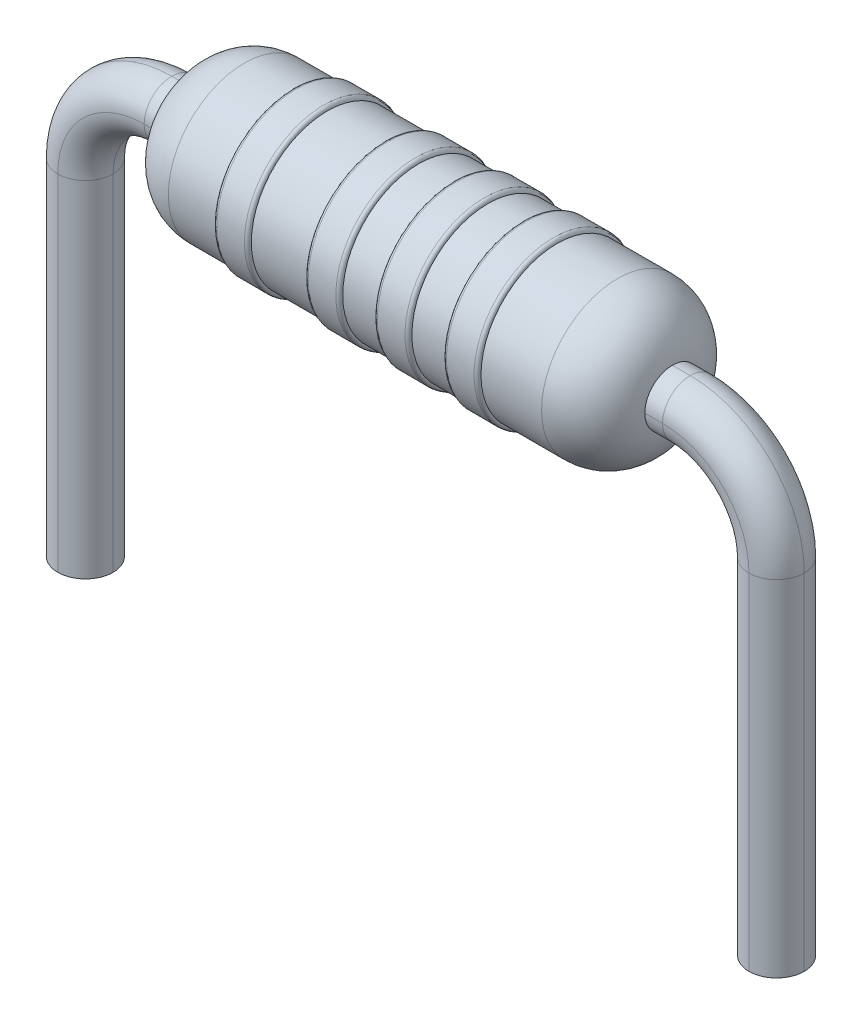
ISO-10303-21;
HEADER;
FILE_DESCRIPTION(('STEP AP214'),'2;1');
FILE_NAME('part.step','',(''),(''),'','','');
FILE_SCHEMA(('AUTOMOTIVE_DESIGN { 1 0 10303 214 1 1 1 1 }'));
ENDSEC;
DATA;
#1=APPLICATION_CONTEXT('core data for automotive mechanical design processes');
#2=APPLICATION_PROTOCOL_DEFINITION('international standard','automotive_design',2000,#1);
#3=PRODUCT_CONTEXT('',#1,'mechanical');
#4=PRODUCT('Part','Part','',(#3));
#5=PRODUCT_RELATED_PRODUCT_CATEGORY('part','',(#4));
#6=PRODUCT_DEFINITION_FORMATION('','',#4);
#7=PRODUCT_DEFINITION_CONTEXT('part definition',#1,'design');
#8=PRODUCT_DEFINITION('design','',#6,#7);
#9=PRODUCT_DEFINITION_SHAPE('','',#8);
#10=(LENGTH_UNIT() NAMED_UNIT(*) SI_UNIT(.MILLI.,.METRE.));
#11=(NAMED_UNIT(*) PLANE_ANGLE_UNIT() SI_UNIT($,.RADIAN.));
#12=(NAMED_UNIT(*) SI_UNIT($,.STERADIAN.) SOLID_ANGLE_UNIT());
#13=UNCERTAINTY_MEASURE_WITH_UNIT(LENGTH_MEASURE(1.E-05),#10,'distance_accuracy_value','');
#14=(GEOMETRIC_REPRESENTATION_CONTEXT(3) GLOBAL_UNCERTAINTY_ASSIGNED_CONTEXT((#13)) GLOBAL_UNIT_ASSIGNED_CONTEXT((#10,
#11,#12)) REPRESENTATION_CONTEXT('',''));
#15=CARTESIAN_POINT('',(0.,0.,0.));
#16=DIRECTION('',(0.,0.,1.));
#17=DIRECTION('',(1.,0.,0.));
#18=AXIS2_PLACEMENT_3D('',#15,#16,#17);
#19=CARTESIAN_POINT('',(2.7,0.,0.));
#20=DIRECTION('',(-1.,0.,0.));
#21=DIRECTION('',(0.,0.,1.));
#22=AXIS2_PLACEMENT_3D('',#19,#20,#21);
#23=DEGENERATE_TOROIDAL_SURFACE('',#22,0.3,0.8,.T.);
#24=CARTESIAN_POINT('',(3.49371157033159,0.00936677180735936,-0.4));
#25=CARTESIAN_POINT('',(3.49377803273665,-0.0131366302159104,-0.400019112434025));
#26=CARTESIAN_POINT('',(3.49384404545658,-0.0356343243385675,-0.398102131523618));
#27=CARTESIAN_POINT('',(3.49397338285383,-0.0799761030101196,-0.390537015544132));
#28=CARTESIAN_POINT('',(3.49403670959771,-0.101820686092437,-0.384891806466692));
#29=CARTESIAN_POINT('',(3.49415902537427,-0.144261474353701,-0.370007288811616));
#30=CARTESIAN_POINT('',(3.4942180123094,-0.164857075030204,-0.360766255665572));
#31=CARTESIAN_POINT('',(3.4943300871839,-0.204201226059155,-0.338960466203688));
#32=CARTESIAN_POINT('',(3.49438317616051,-0.222950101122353,-0.326396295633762));
#33=CARTESIAN_POINT('',(3.49448214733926,-0.258072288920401,-0.298298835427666));
#34=CARTESIAN_POINT('',(3.49452802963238,-0.274445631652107,-0.282765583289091));
#35=CARTESIAN_POINT('',(3.49461150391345,-0.304355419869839,-0.249167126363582));
#36=CARTESIAN_POINT('',(3.49464909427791,-0.317891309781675,-0.231101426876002));
#37=CARTESIAN_POINT('',(3.49471511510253,-0.341739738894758,-0.192952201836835));
#38=CARTESIAN_POINT('',(3.49474354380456,-0.352051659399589,-0.172868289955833));
#39=CARTESIAN_POINT('',(3.49479058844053,-0.369151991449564,-0.131258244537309));
#40=CARTESIAN_POINT('',(3.49480921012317,-0.375942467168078,-0.109732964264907));
#41=CARTESIAN_POINT('',(3.49483161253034,-0.38411954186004,-0.0733966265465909));
#42=CARTESIAN_POINT('',(3.4948382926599,-0.386560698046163,-0.0588141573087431));
#43=CARTESIAN_POINT('',(3.49484720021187,-0.389817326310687,-0.0294898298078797));
#44=CARTESIAN_POINT('',(3.494849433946,-0.39063510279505,-0.014748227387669));
#45=CARTESIAN_POINT('',(3.49484943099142,-0.390633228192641,0.));
#46=B_SPLINE_CURVE_WITH_KNOTS('',3,(#24,#25,#26,#27,#28,#29,#30,#31,#32,#33,#34,#35,#36,#37,#38,
#39,#40,#41,#42,#43,#44,#45),.UNSPECIFIED.,.F.,.F.,(4,2,2,2,2,2,2,2,2,2,4),(0.,
0.0674208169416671,0.134788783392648,0.202189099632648,0.269577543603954,0.336965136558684,
0.404365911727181,0.47177961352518,0.539153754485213,0.583425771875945,0.627634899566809),.UNSPECIFIED.);
#47=CARTESIAN_POINT('',(3.49371157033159,0.00936677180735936,-0.4));
#48=VERTEX_POINT('',#47);
#49=CARTESIAN_POINT('',(3.49484943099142,-0.390633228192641,0.));
#50=VERTEX_POINT('',#49);
#51=EDGE_CURVE('E47',#48,#50,#46,.T.);
#52=ORIENTED_EDGE('',*,*,#51,.T.);
#53=CARTESIAN_POINT('',(3.49484943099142,-0.390633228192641,0.));
#54=CARTESIAN_POINT('',(3.49484947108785,-0.390652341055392,0.0225032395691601));
#55=CARTESIAN_POINT('',(3.49484424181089,-0.38873538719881,0.0450007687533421));
#56=CARTESIAN_POINT('',(3.49482354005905,-0.381170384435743,0.0893422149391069));
#57=CARTESIAN_POINT('',(3.4948080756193,-0.375525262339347,0.111186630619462));
#58=CARTESIAN_POINT('',(3.49476718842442,-0.360640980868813,0.153627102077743));
#59=CARTESIAN_POINT('',(3.49474176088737,-0.351400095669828,0.174222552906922));
#60=CARTESIAN_POINT('',(3.49468152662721,-0.32959466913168,0.213566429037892));
#61=CARTESIAN_POINT('',(3.4946467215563,-0.317030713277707,0.232315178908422));
#62=CARTESIAN_POINT('',(3.49456851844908,-0.288933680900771,0.267437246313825));
#63=CARTESIAN_POINT('',(3.4945251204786,-0.273400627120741,0.283810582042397));
#64=CARTESIAN_POINT('',(3.49443074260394,-0.239802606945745,0.313720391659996));
#65=CARTESIAN_POINT('',(3.49437976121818,-0.221737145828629,0.327256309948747));
#66=CARTESIAN_POINT('',(3.49427146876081,-0.183588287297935,0.351104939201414));
#67=CARTESIAN_POINT('',(3.4942141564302,-0.163504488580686,0.361417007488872));
#68=CARTESIAN_POINT('',(3.49409468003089,-0.121894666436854,0.378517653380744));
#69=CARTESIAN_POINT('',(3.49403251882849,-0.100369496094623,0.385308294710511));
#70=CARTESIAN_POINT('',(3.49392692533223,-0.0640327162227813,0.393485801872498));
#71=CARTESIAN_POINT('',(3.4938843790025,-0.0494496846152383,0.395927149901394));
#72=CARTESIAN_POINT('',(3.49379847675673,-0.0201242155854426,0.399184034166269));
#73=CARTESIAN_POINT('',(3.49375512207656,-0.00538203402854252,0.400001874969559));
#74=CARTESIAN_POINT('',(3.49371157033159,0.00936677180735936,0.4));
#75=B_SPLINE_CURVE_WITH_KNOTS('',3,(#53,#54,#55,#56,#57,#58,#59,#60,#61,#62,#63,#64,#65,#66,#67,
#68,#69,#70,#71,#72,#73,#74),.UNSPECIFIED.,.F.,.F.,(4,2,2,2,2,2,2,2,2,2,4),(0.,
0.0674200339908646,0.134787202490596,0.202186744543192,0.269574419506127,0.33696157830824,
0.404361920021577,0.471775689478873,0.539149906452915,0.583423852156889,0.627634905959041),.UNSPECIFIED.);
#76=CARTESIAN_POINT('',(3.49371157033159,0.00936677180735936,0.4));
#77=VERTEX_POINT('',#76);
#78=EDGE_CURVE('E386',#50,#77,#75,.T.);
#79=ORIENTED_EDGE('',*,*,#78,.T.);
#80=CARTESIAN_POINT('',(3.49371157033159,0.00936677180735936,0.4));
#81=CARTESIAN_POINT('',(3.49364513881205,0.0318701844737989,0.400019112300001));
#82=CARTESIAN_POINT('',(3.49357829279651,0.0543678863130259,0.398102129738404));
#83=CARTESIAN_POINT('',(3.49344578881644,0.0987096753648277,0.390537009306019));
#84=CARTESIAN_POINT('',(3.49338012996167,0.120554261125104,0.384891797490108));
#85=CARTESIAN_POINT('',(3.49325187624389,0.162995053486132,0.370007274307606));
#86=CARTESIAN_POINT('',(3.49318928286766,0.183590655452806,0.360766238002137));
#87=CARTESIAN_POINT('',(3.49306913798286,0.22293480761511,0.338960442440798));
#88=CARTESIAN_POINT('',(3.4930115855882,0.241683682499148,0.326396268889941));
#89=CARTESIAN_POINT('',(3.49290333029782,0.276805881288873,0.298298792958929));
#90=CARTESIAN_POINT('',(3.49285262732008,0.293179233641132,0.282765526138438));
#91=CARTESIAN_POINT('',(3.49275969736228,0.3230890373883,0.249167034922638));
#92=CARTESIAN_POINT('',(3.49271747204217,0.336624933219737,0.231101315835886));
#93=CARTESIAN_POINT('',(3.4926428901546,0.36047336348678,0.192952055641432));
#94=CARTESIAN_POINT('',(3.49261053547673,0.370785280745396,0.172868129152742));
#95=CARTESIAN_POINT('',(3.49255679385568,0.387885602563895,0.131258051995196));
#96=CARTESIAN_POINT('',(3.49253540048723,0.3946760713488,0.109732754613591));
#97=CARTESIAN_POINT('',(3.49250961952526,0.402853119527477,0.0733964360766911));
#98=CARTESIAN_POINT('',(3.4925019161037,0.40529426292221,0.0588140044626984));
#99=CARTESIAN_POINT('',(3.4924916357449,0.408550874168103,0.0294897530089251));
#100=CARTESIAN_POINT('',(3.49248905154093,0.409368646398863,0.0147481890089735));
#101=CARTESIAN_POINT('',(3.49248905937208,0.409366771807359,0.));
#102=B_SPLINE_CURVE_WITH_KNOTS('',3,(#80,#81,#82,#83,#84,#85,#86,#87,#88,#89,#90,#91,#92,#93,
#94,#95,#96,#97,#98,#99,#100,#101),.UNSPECIFIED.,.F.,.F.,(4,2,2,2,2,2,2,2,2,2,4),(0.,
0.0674208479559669,0.13478884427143,0.202189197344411,0.269577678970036,0.336965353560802,
0.404366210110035,0.47177996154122,0.539154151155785,0.583426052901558,0.627635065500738),.UNSPECIFIED.);
#103=CARTESIAN_POINT('',(3.49248905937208,0.409366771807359,0.));
#104=VERTEX_POINT('',#103);
#105=EDGE_CURVE('E180',#77,#104,#102,.T.);
#106=ORIENTED_EDGE('',*,*,#105,.T.);
#107=CARTESIAN_POINT('',(3.49248905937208,0.409366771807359,0.));
#108=CARTESIAN_POINT('',(3.49248898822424,0.409385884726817,-0.0225032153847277));
#109=CARTESIAN_POINT('',(3.49249505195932,0.407468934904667,-0.0450007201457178));
#110=CARTESIAN_POINT('',(3.49251892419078,0.399903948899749,-0.0893421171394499));
#111=CARTESIAN_POINT('',(3.49253672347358,0.394258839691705,-0.111186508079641));
#112=CARTESIAN_POINT('',(3.49258355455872,0.3793745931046,-0.153626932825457));
#113=CARTESIAN_POINT('',(3.49261259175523,0.370133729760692,-0.174222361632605));
#114=CARTESIAN_POINT('',(3.49268090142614,0.348328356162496,-0.213566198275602));
#115=CARTESIAN_POINT('',(3.49272017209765,0.335764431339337,-0.232314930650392));
#116=CARTESIAN_POINT('',(3.49280766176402,0.307667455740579,-0.267436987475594));
#117=CARTESIAN_POINT('',(3.49285588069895,0.292134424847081,-0.283810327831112));
#118=CARTESIAN_POINT('',(3.4929597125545,0.258536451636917,-0.313720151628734));
#119=CARTESIAN_POINT('',(3.4930153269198,0.240471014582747,-0.327256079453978));
#120=CARTESIAN_POINT('',(3.49313217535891,0.202322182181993,-0.351104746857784));
#121=CARTESIAN_POINT('',(3.4931934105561,0.182238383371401,-0.361416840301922));
#122=CARTESIAN_POINT('',(3.49331957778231,0.14062855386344,-0.378517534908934));
#123=CARTESIAN_POINT('',(3.49338450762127,0.119103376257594,-0.385308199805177));
#124=CARTESIAN_POINT('',(3.4934934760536,0.0827665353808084,-0.393485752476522));
#125=CARTESIAN_POINT('',(3.49353704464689,0.0681834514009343,-0.395927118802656));
#126=CARTESIAN_POINT('',(3.49362431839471,0.0388578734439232,-0.399184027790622));
#127=CARTESIAN_POINT('',(3.49366802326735,0.0241156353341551,-0.400001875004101));
#128=CARTESIAN_POINT('',(3.49371157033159,0.00936677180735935,-0.4));
#129=B_SPLINE_CURVE_WITH_KNOTS('',3,(#107,#108,#109,#110,#111,#112,#113,#114,#115,#116,#117,
#118,#119,#120,#121,#122,#123,#124,#125,#126,#127,#128),.UNSPECIFIED.,.F.,.F.,(4,2,2,2,2,2,2,2,
2,2,4),(0.,0.0674199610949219,0.134787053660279,0.202186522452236,0.26957412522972,
0.336961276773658,0.404361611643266,0.471775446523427,0.539149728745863,0.58342384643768,
0.627635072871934),.UNSPECIFIED.);
#130=EDGE_CURVE('E410',#104,#48,#129,.T.);
#131=ORIENTED_EDGE('',*,*,#130,.T.);
#132=EDGE_LOOP('',(#52,#79,#106,#131));
#133=FACE_BOUND('',#132,.T.);
#134=CARTESIAN_POINT('',(2.69999999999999,0.,0.));
#135=DIRECTION('',(-1.,0.,0.));
#136=DIRECTION('',(0.,0.,1.));
#137=AXIS2_PLACEMENT_3D('',#134,#135,#136);
#138=CIRCLE('',#137,1.1);
#139=CARTESIAN_POINT('',(2.69999999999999,0.,1.1));
#140=VERTEX_POINT('',#139);
#141=EDGE_CURVE('E276',#140,#140,#138,.T.);
#142=ORIENTED_EDGE('',*,*,#141,.F.);
#143=EDGE_LOOP('',(#142));
#144=FACE_BOUND('',#143,.T.);
#145=ADVANCED_FACE('F27',(#133,#144),#23,.T.);
#146=CARTESIAN_POINT('',(-2.7,0.,0.));
#147=DIRECTION('',(-1.,0.,0.));
#148=DIRECTION('',(0.,0.,1.));
#149=AXIS2_PLACEMENT_3D('',#146,#147,#148);
#150=DEGENERATE_TOROIDAL_SURFACE('',#149,0.3,0.8,.T.);
#151=CARTESIAN_POINT('',(-3.49371157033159,0.00936677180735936,-0.4));
#152=CARTESIAN_POINT('',(-3.49364513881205,0.0318701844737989,-0.400019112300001));
#153=CARTESIAN_POINT('',(-3.49357829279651,0.0543678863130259,-0.398102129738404));
#154=CARTESIAN_POINT('',(-3.49344578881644,0.0987096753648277,-0.390537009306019));
#155=CARTESIAN_POINT('',(-3.49338012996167,0.120554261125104,-0.384891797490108));
#156=CARTESIAN_POINT('',(-3.49325187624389,0.162995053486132,-0.370007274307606));
#157=CARTESIAN_POINT('',(-3.49318928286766,0.183590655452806,-0.360766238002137));
#158=CARTESIAN_POINT('',(-3.49306913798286,0.22293480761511,-0.338960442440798));
#159=CARTESIAN_POINT('',(-3.4930115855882,0.241683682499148,-0.326396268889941));
#160=CARTESIAN_POINT('',(-3.49290333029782,0.276805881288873,-0.298298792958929));
#161=CARTESIAN_POINT('',(-3.49285262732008,0.293179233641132,-0.282765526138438));
#162=CARTESIAN_POINT('',(-3.49275969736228,0.3230890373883,-0.249167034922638));
#163=CARTESIAN_POINT('',(-3.49271747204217,0.336624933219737,-0.231101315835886));
#164=CARTESIAN_POINT('',(-3.4926428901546,0.36047336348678,-0.192952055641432));
#165=CARTESIAN_POINT('',(-3.49261053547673,0.370785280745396,-0.172868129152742));
#166=CARTESIAN_POINT('',(-3.49255679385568,0.387885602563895,-0.131258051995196));
#167=CARTESIAN_POINT('',(-3.49253540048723,0.3946760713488,-0.109732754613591));
#168=CARTESIAN_POINT('',(-3.49250961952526,0.402853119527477,-0.0733964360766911));
#169=CARTESIAN_POINT('',(-3.4925019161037,0.40529426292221,-0.0588140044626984));
#170=CARTESIAN_POINT('',(-3.4924916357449,0.408550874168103,-0.0294897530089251));
#171=CARTESIAN_POINT('',(-3.49248905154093,0.409368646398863,-0.0147481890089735));
#172=CARTESIAN_POINT('',(-3.49248905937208,0.409366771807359,0.));
#173=B_SPLINE_CURVE_WITH_KNOTS('',3,(#151,#152,#153,#154,#155,#156,#157,#158,#159,#160,#161,
#162,#163,#164,#165,#166,#167,#168,#169,#170,#171,#172),.UNSPECIFIED.,.F.,.F.,(4,2,2,2,2,2,2,2,
2,2,4),(0.,0.0674208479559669,0.13478884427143,0.202189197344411,0.269577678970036,
0.336965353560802,0.404366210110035,0.47177996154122,0.539154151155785,0.583426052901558,
0.627635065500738),.UNSPECIFIED.);
#174=CARTESIAN_POINT('',(-3.49371157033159,0.00936677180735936,-0.4));
#175=VERTEX_POINT('',#174);
#176=CARTESIAN_POINT('',(-3.49248905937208,0.409366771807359,0.));
#177=VERTEX_POINT('',#176);
#178=EDGE_CURVE('E344',#175,#177,#173,.T.);
#179=ORIENTED_EDGE('',*,*,#178,.T.);
#180=CARTESIAN_POINT('',(-3.49248905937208,0.409366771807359,0.));
#181=CARTESIAN_POINT('',(-3.49248898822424,0.409385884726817,0.0225032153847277));
#182=CARTESIAN_POINT('',(-3.49249505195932,0.407468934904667,0.0450007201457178));
#183=CARTESIAN_POINT('',(-3.49251892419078,0.399903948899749,0.0893421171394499));
#184=CARTESIAN_POINT('',(-3.49253672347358,0.394258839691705,0.111186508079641));
#185=CARTESIAN_POINT('',(-3.49258355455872,0.3793745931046,0.153626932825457));
#186=CARTESIAN_POINT('',(-3.49261259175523,0.370133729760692,0.174222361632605));
#187=CARTESIAN_POINT('',(-3.49268090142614,0.348328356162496,0.213566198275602));
#188=CARTESIAN_POINT('',(-3.49272017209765,0.335764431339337,0.232314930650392));
#189=CARTESIAN_POINT('',(-3.49280766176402,0.307667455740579,0.267436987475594));
#190=CARTESIAN_POINT('',(-3.49285588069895,0.292134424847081,0.283810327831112));
#191=CARTESIAN_POINT('',(-3.4929597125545,0.258536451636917,0.313720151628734));
#192=CARTESIAN_POINT('',(-3.4930153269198,0.240471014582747,0.327256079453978));
#193=CARTESIAN_POINT('',(-3.49313217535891,0.202322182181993,0.351104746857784));
#194=CARTESIAN_POINT('',(-3.4931934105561,0.182238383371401,0.361416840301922));
#195=CARTESIAN_POINT('',(-3.49331957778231,0.14062855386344,0.378517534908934));
#196=CARTESIAN_POINT('',(-3.49338450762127,0.119103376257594,0.385308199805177));
#197=CARTESIAN_POINT('',(-3.4934934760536,0.0827665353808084,0.393485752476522));
#198=CARTESIAN_POINT('',(-3.49353704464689,0.0681834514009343,0.395927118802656));
#199=CARTESIAN_POINT('',(-3.49362431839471,0.0388578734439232,0.399184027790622));
#200=CARTESIAN_POINT('',(-3.49366802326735,0.0241156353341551,0.400001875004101));
#201=CARTESIAN_POINT('',(-3.49371157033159,0.00936677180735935,0.4));
#202=B_SPLINE_CURVE_WITH_KNOTS('',3,(#180,#181,#182,#183,#184,#185,#186,#187,#188,#189,#190,
#191,#192,#193,#194,#195,#196,#197,#198,#199,#200,#201),.UNSPECIFIED.,.F.,.F.,(4,2,2,2,2,2,2,2,
2,2,4),(0.,0.0674199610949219,0.134787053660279,0.202186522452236,0.26957412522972,
0.336961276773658,0.404361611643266,0.471775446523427,0.539149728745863,0.58342384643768,
0.627635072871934),.UNSPECIFIED.);
#203=CARTESIAN_POINT('',(-3.49371157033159,0.00936677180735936,0.4));
#204=VERTEX_POINT('',#203);
#205=EDGE_CURVE('E11',#177,#204,#202,.T.);
#206=ORIENTED_EDGE('',*,*,#205,.T.);
#207=CARTESIAN_POINT('',(-3.49371157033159,0.00936677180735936,0.4));
#208=CARTESIAN_POINT('',(-3.49377803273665,-0.0131366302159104,0.400019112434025));
#209=CARTESIAN_POINT('',(-3.49384404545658,-0.0356343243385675,0.398102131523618));
#210=CARTESIAN_POINT('',(-3.49397338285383,-0.0799761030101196,0.390537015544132));
#211=CARTESIAN_POINT('',(-3.49403670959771,-0.101820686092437,0.384891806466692));
#212=CARTESIAN_POINT('',(-3.49415902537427,-0.144261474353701,0.370007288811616));
#213=CARTESIAN_POINT('',(-3.4942180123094,-0.164857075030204,0.360766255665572));
#214=CARTESIAN_POINT('',(-3.4943300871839,-0.204201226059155,0.338960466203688));
#215=CARTESIAN_POINT('',(-3.49438317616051,-0.222950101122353,0.326396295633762));
#216=CARTESIAN_POINT('',(-3.49448214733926,-0.258072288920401,0.298298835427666));
#217=CARTESIAN_POINT('',(-3.49452802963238,-0.274445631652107,0.282765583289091));
#218=CARTESIAN_POINT('',(-3.49461150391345,-0.304355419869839,0.249167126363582));
#219=CARTESIAN_POINT('',(-3.49464909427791,-0.317891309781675,0.231101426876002));
#220=CARTESIAN_POINT('',(-3.49471511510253,-0.341739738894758,0.192952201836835));
#221=CARTESIAN_POINT('',(-3.49474354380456,-0.352051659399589,0.172868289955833));
#222=CARTESIAN_POINT('',(-3.49479058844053,-0.369151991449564,0.131258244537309));
#223=CARTESIAN_POINT('',(-3.49480921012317,-0.375942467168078,0.109732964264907));
#224=CARTESIAN_POINT('',(-3.49483161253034,-0.38411954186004,0.0733966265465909));
#225=CARTESIAN_POINT('',(-3.4948382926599,-0.386560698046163,0.0588141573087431));
#226=CARTESIAN_POINT('',(-3.49484720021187,-0.389817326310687,0.0294898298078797));
#227=CARTESIAN_POINT('',(-3.494849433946,-0.39063510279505,0.014748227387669));
#228=CARTESIAN_POINT('',(-3.49484943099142,-0.390633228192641,0.));
#229=B_SPLINE_CURVE_WITH_KNOTS('',3,(#207,#208,#209,#210,#211,#212,#213,#214,#215,#216,#217,
#218,#219,#220,#221,#222,#223,#224,#225,#226,#227,#228),.UNSPECIFIED.,.F.,.F.,(4,2,2,2,2,2,2,2,
2,2,4),(0.,0.0674208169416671,0.134788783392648,0.202189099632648,0.269577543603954,
0.336965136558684,0.404365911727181,0.47177961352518,0.539153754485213,0.583425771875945,
0.627634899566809),.UNSPECIFIED.);
#230=CARTESIAN_POINT('',(-3.49484943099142,-0.390633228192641,0.));
#231=VERTEX_POINT('',#230);
#232=EDGE_CURVE('E55',#204,#231,#229,.T.);
#233=ORIENTED_EDGE('',*,*,#232,.T.);
#234=CARTESIAN_POINT('',(-3.49484943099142,-0.390633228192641,0.));
#235=CARTESIAN_POINT('',(-3.49484947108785,-0.390652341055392,-0.0225032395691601));
#236=CARTESIAN_POINT('',(-3.49484424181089,-0.38873538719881,-0.0450007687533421));
#237=CARTESIAN_POINT('',(-3.49482354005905,-0.381170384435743,-0.0893422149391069));
#238=CARTESIAN_POINT('',(-3.4948080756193,-0.375525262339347,-0.111186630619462));
#239=CARTESIAN_POINT('',(-3.49476718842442,-0.360640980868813,-0.153627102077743));
#240=CARTESIAN_POINT('',(-3.49474176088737,-0.351400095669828,-0.174222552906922));
#241=CARTESIAN_POINT('',(-3.49468152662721,-0.32959466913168,-0.213566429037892));
#242=CARTESIAN_POINT('',(-3.4946467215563,-0.317030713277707,-0.232315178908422));
#243=CARTESIAN_POINT('',(-3.49456851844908,-0.288933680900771,-0.267437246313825));
#244=CARTESIAN_POINT('',(-3.4945251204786,-0.273400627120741,-0.283810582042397));
#245=CARTESIAN_POINT('',(-3.49443074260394,-0.239802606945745,-0.313720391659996));
#246=CARTESIAN_POINT('',(-3.49437976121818,-0.221737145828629,-0.327256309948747));
#247=CARTESIAN_POINT('',(-3.49427146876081,-0.183588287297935,-0.351104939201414));
#248=CARTESIAN_POINT('',(-3.4942141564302,-0.163504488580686,-0.361417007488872));
#249=CARTESIAN_POINT('',(-3.49409468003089,-0.121894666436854,-0.378517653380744));
#250=CARTESIAN_POINT('',(-3.49403251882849,-0.100369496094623,-0.385308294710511));
#251=CARTESIAN_POINT('',(-3.49392692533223,-0.0640327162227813,-0.393485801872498));
#252=CARTESIAN_POINT('',(-3.4938843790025,-0.0494496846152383,-0.395927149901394));
#253=CARTESIAN_POINT('',(-3.49379847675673,-0.0201242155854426,-0.399184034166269));
#254=CARTESIAN_POINT('',(-3.49375512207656,-0.00538203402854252,-0.400001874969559));
#255=CARTESIAN_POINT('',(-3.49371157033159,0.00936677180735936,-0.4));
#256=B_SPLINE_CURVE_WITH_KNOTS('',3,(#234,#235,#236,#237,#238,#239,#240,#241,#242,#243,#244,
#245,#246,#247,#248,#249,#250,#251,#252,#253,#254,#255),.UNSPECIFIED.,.F.,.F.,(4,2,2,2,2,2,2,2,
2,2,4),(0.,0.0674200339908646,0.134787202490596,0.202186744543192,0.269574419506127,
0.33696157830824,0.404361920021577,0.471775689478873,0.539149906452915,0.583423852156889,
0.627634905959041),.UNSPECIFIED.);
#257=EDGE_CURVE('E40',#231,#175,#256,.T.);
#258=ORIENTED_EDGE('',*,*,#257,.T.);
#259=EDGE_LOOP('',(#179,#206,#233,#258));
#260=FACE_BOUND('',#259,.T.);
#261=CARTESIAN_POINT('',(-2.69999999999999,0.,0.));
#262=DIRECTION('',(-1.,0.,0.));
#263=DIRECTION('',(0.,0.,1.));
#264=AXIS2_PLACEMENT_3D('',#261,#262,#263);
#265=CIRCLE('',#264,1.1);
#266=CARTESIAN_POINT('',(-2.69999999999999,0.,1.1));
#267=VERTEX_POINT('',#266);
#268=EDGE_CURVE('E273',#267,#267,#265,.T.);
#269=ORIENTED_EDGE('',*,*,#268,.T.);
#270=EDGE_LOOP('',(#269));
#271=FACE_BOUND('',#270,.T.);
#272=ADVANCED_FACE('F356',(#260,#271),#150,.T.);
#273=CARTESIAN_POINT('',(-54.2686615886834,0.,0.));
#274=DIRECTION('',(-1.,0.,0.));
#275=DIRECTION('',(0.,0.,1.));
#276=AXIS2_PLACEMENT_3D('',#273,#274,#275);
#277=CYLINDRICAL_SURFACE('',#276,1.1);
#278=CARTESIAN_POINT('',(0.322975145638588,0.,0.));
#279=DIRECTION('',(-1.,0.,0.));
#280=DIRECTION('',(0.,0.,1.));
#281=AXIS2_PLACEMENT_3D('',#278,#279,#280);
#282=CIRCLE('',#281,1.1);
#283=CARTESIAN_POINT('',(0.322975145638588,0.,1.1));
#284=VERTEX_POINT('',#283);
#285=EDGE_CURVE('E287',#284,#284,#282,.T.);
#286=ORIENTED_EDGE('',*,*,#285,.T.);
#287=EDGE_LOOP('',(#286));
#288=FACE_BOUND('',#287,.T.);
#289=CARTESIAN_POINT('',(-0.177024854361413,0.,0.));
#290=DIRECTION('',(1.,0.,0.));
#291=DIRECTION('',(0.,0.,-1.));
#292=AXIS2_PLACEMENT_3D('',#289,#290,#291);
#293=CIRCLE('',#292,1.1);
#294=CARTESIAN_POINT('',(-0.177024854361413,0.,-1.1));
#295=VERTEX_POINT('',#294);
#296=EDGE_CURVE('E277',#295,#295,#293,.T.);
#297=ORIENTED_EDGE('',*,*,#296,.T.);
#298=EDGE_LOOP('',(#297));
#299=FACE_BOUND('',#298,.T.);
#300=ADVANCED_FACE('F498',(#288,#299),#277,.T.);
#301=CARTESIAN_POINT('',(4.3261723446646,0.,0.));
#302=DIRECTION('',(1.,0.,0.));
#303=DIRECTION('',(0.,0.,-1.));
#304=AXIS2_PLACEMENT_3D('',#301,#302,#303);
#305=CYLINDRICAL_SURFACE('',#304,1.15);
#306=CARTESIAN_POINT('',(-0.627024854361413,0.,0.));
#307=DIRECTION('',(-1.,0.,0.));
#308=DIRECTION('',(0.,0.,1.));
#309=AXIS2_PLACEMENT_3D('',#306,#307,#308);
#310=CIRCLE('',#309,1.15);
#311=CARTESIAN_POINT('',(-0.627024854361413,0.,1.15));
#312=VERTEX_POINT('',#311);
#313=EDGE_CURVE('E311',#312,#312,#310,.F.);
#314=ORIENTED_EDGE('',*,*,#313,.T.);
#315=EDGE_LOOP('',(#314));
#316=FACE_BOUND('',#315,.T.);
#317=CARTESIAN_POINT('',(-0.227024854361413,0.,0.));
#318=DIRECTION('',(1.,0.,0.));
#319=DIRECTION('',(0.,0.,-1.));
#320=AXIS2_PLACEMENT_3D('',#317,#318,#319);
#321=CIRCLE('',#320,1.15);
#322=CARTESIAN_POINT('',(-0.227024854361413,0.,-1.15));
#323=VERTEX_POINT('',#322);
#324=EDGE_CURVE('E308',#323,#323,#321,.F.);
#325=ORIENTED_EDGE('',*,*,#324,.T.);
#326=EDGE_LOOP('',(#325));
#327=FACE_BOUND('',#326,.T.);
#328=ADVANCED_FACE('F496',(#316,#327),#305,.T.);
#329=CARTESIAN_POINT('',(-1.5,0.,0.));
#330=DIRECTION('',(1.,0.,0.));
#331=DIRECTION('',(0.,0.,-1.));
#332=AXIS2_PLACEMENT_3D('',#329,#330,#331);
#333=CIRCLE('',#332,1.1);
#334=CARTESIAN_POINT('',(-1.5,0.,-1.1));
#335=VERTEX_POINT('',#334);
#336=EDGE_CURVE('E272',#335,#335,#333,.T.);
#337=ORIENTED_EDGE('',*,*,#336,.T.);
#338=EDGE_LOOP('',(#337));
#339=FACE_BOUND('',#338,.T.);
#340=CARTESIAN_POINT('',(-0.677024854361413,0.,0.));
#341=DIRECTION('',(-1.,0.,0.));
#342=DIRECTION('',(0.,0.,1.));
#343=AXIS2_PLACEMENT_3D('',#340,#341,#342);
#344=CIRCLE('',#343,1.1);
#345=CARTESIAN_POINT('',(-0.677024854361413,0.,1.1));
#346=VERTEX_POINT('',#345);
#347=EDGE_CURVE('E281',#346,#346,#344,.T.);
#348=ORIENTED_EDGE('',*,*,#347,.T.);
#349=EDGE_LOOP('',(#348));
#350=FACE_BOUND('',#349,.T.);
#351=ADVANCED_FACE('F494',(#339,#350),#277,.T.);
#352=CARTESIAN_POINT('',(4.3261723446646,0.,0.));
#353=DIRECTION('',(1.,0.,0.));
#354=DIRECTION('',(0.,0.,-1.));
#355=AXIS2_PLACEMENT_3D('',#352,#353,#354);
#356=CYLINDRICAL_SURFACE('',#355,1.15);
#357=CARTESIAN_POINT('',(0.372975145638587,0.,0.));
#358=DIRECTION('',(-1.,0.,0.));
#359=DIRECTION('',(0.,0.,1.));
#360=AXIS2_PLACEMENT_3D('',#357,#358,#359);
#361=CIRCLE('',#360,1.15);
#362=CARTESIAN_POINT('',(0.372975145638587,0.,1.15));
#363=VERTEX_POINT('',#362);
#364=EDGE_CURVE('E317',#363,#363,#361,.F.);
#365=ORIENTED_EDGE('',*,*,#364,.T.);
#366=EDGE_LOOP('',(#365));
#367=FACE_BOUND('',#366,.T.);
#368=CARTESIAN_POINT('',(0.772975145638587,0.,0.));
#369=DIRECTION('',(1.,0.,0.));
#370=DIRECTION('',(0.,0.,-1.));
#371=AXIS2_PLACEMENT_3D('',#368,#369,#370);
#372=CIRCLE('',#371,1.15);
#373=CARTESIAN_POINT('',(0.772975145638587,0.,-1.15));
#374=VERTEX_POINT('',#373);
#375=EDGE_CURVE('E314',#374,#374,#372,.F.);
#376=ORIENTED_EDGE('',*,*,#375,.T.);
#377=EDGE_LOOP('',(#376));
#378=FACE_BOUND('',#377,.T.);
#379=ADVANCED_FACE('F492',(#367,#378),#356,.T.);
#380=CARTESIAN_POINT('',(1.32297514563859,0.,0.));
#381=DIRECTION('',(-1.,0.,0.));
#382=DIRECTION('',(0.,0.,1.));
#383=AXIS2_PLACEMENT_3D('',#380,#381,#382);
#384=CIRCLE('',#383,1.1);
#385=CARTESIAN_POINT('',(1.32297514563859,0.,1.1));
#386=VERTEX_POINT('',#385);
#387=EDGE_CURVE('E293',#386,#386,#384,.T.);
#388=ORIENTED_EDGE('',*,*,#387,.T.);
#389=EDGE_LOOP('',(#388));
#390=FACE_BOUND('',#389,.T.);
#391=CARTESIAN_POINT('',(0.822975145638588,0.,0.));
#392=DIRECTION('',(1.,0.,0.));
#393=DIRECTION('',(0.,0.,-1.));
#394=AXIS2_PLACEMENT_3D('',#391,#392,#393);
#395=CIRCLE('',#394,1.1);
#396=CARTESIAN_POINT('',(0.822975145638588,0.,-1.1));
#397=VERTEX_POINT('',#396);
#398=EDGE_CURVE('E284',#397,#397,#395,.T.);
#399=ORIENTED_EDGE('',*,*,#398,.T.);
#400=EDGE_LOOP('',(#399));
#401=FACE_BOUND('',#400,.T.);
#402=ADVANCED_FACE('F490',(#390,#401),#277,.T.);
#403=CARTESIAN_POINT('',(4.3261723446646,0.,0.));
#404=DIRECTION('',(1.,0.,0.));
#405=DIRECTION('',(0.,0.,-1.));
#406=AXIS2_PLACEMENT_3D('',#403,#404,#405);
#407=CYLINDRICAL_SURFACE('',#406,1.15);
#408=CARTESIAN_POINT('',(1.37297514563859,0.,0.));
#409=DIRECTION('',(-1.,0.,0.));
#410=DIRECTION('',(0.,0.,1.));
#411=AXIS2_PLACEMENT_3D('',#408,#409,#410);
#412=CIRCLE('',#411,1.15);
#413=CARTESIAN_POINT('',(1.37297514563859,0.,1.15));
#414=VERTEX_POINT('',#413);
#415=EDGE_CURVE('E323',#414,#414,#412,.F.);
#416=ORIENTED_EDGE('',*,*,#415,.T.);
#417=EDGE_LOOP('',(#416));
#418=FACE_BOUND('',#417,.T.);
#419=CARTESIAN_POINT('',(1.77297514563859,0.,0.));
#420=DIRECTION('',(1.,0.,0.));
#421=DIRECTION('',(0.,0.,-1.));
#422=AXIS2_PLACEMENT_3D('',#419,#420,#421);
#423=CIRCLE('',#422,1.15);
#424=CARTESIAN_POINT('',(1.77297514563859,0.,-1.15));
#425=VERTEX_POINT('',#424);
#426=EDGE_CURVE('E320',#425,#425,#423,.F.);
#427=ORIENTED_EDGE('',*,*,#426,.T.);
#428=EDGE_LOOP('',(#427));
#429=FACE_BOUND('',#428,.T.);
#430=ADVANCED_FACE('F487',(#418,#429),#407,.T.);
#431=CARTESIAN_POINT('',(1.82297514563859,0.,0.));
#432=DIRECTION('',(1.,0.,0.));
#433=DIRECTION('',(0.,0.,-1.));
#434=AXIS2_PLACEMENT_3D('',#431,#432,#433);
#435=CIRCLE('',#434,1.1);
#436=CARTESIAN_POINT('',(1.82297514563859,0.,-1.1));
#437=VERTEX_POINT('',#436);
#438=EDGE_CURVE('E290',#437,#437,#435,.T.);
#439=ORIENTED_EDGE('',*,*,#438,.T.);
#440=EDGE_LOOP('',(#439));
#441=FACE_BOUND('',#440,.T.);
#442=ORIENTED_EDGE('',*,*,#141,.T.);
#443=EDGE_LOOP('',(#442));
#444=FACE_BOUND('',#443,.T.);
#445=ADVANCED_FACE('F485',(#441,#444),#277,.T.);
#446=CARTESIAN_POINT('',(4.3261723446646,0.,0.));
#447=DIRECTION('',(1.,0.,0.));
#448=DIRECTION('',(0.,0.,-1.));
#449=AXIS2_PLACEMENT_3D('',#446,#447,#448);
#450=CYLINDRICAL_SURFACE('',#449,1.15);
#451=CARTESIAN_POINT('',(-1.95,0.,0.));
#452=DIRECTION('',(-1.,0.,0.));
#453=DIRECTION('',(0.,0.,1.));
#454=AXIS2_PLACEMENT_3D('',#451,#452,#453);
#455=CIRCLE('',#454,1.15);
#456=CARTESIAN_POINT('',(-1.95,0.,1.15));
#457=VERTEX_POINT('',#456);
#458=EDGE_CURVE('E305',#457,#457,#455,.F.);
#459=ORIENTED_EDGE('',*,*,#458,.T.);
#460=EDGE_LOOP('',(#459));
#461=FACE_BOUND('',#460,.T.);
#462=CARTESIAN_POINT('',(-1.55,0.,0.));
#463=DIRECTION('',(1.,0.,0.));
#464=DIRECTION('',(0.,0.,-1.));
#465=AXIS2_PLACEMENT_3D('',#462,#463,#464);
#466=CIRCLE('',#465,1.15);
#467=CARTESIAN_POINT('',(-1.55,0.,-1.15));
#468=VERTEX_POINT('',#467);
#469=EDGE_CURVE('E280',#468,#468,#466,.F.);
#470=ORIENTED_EDGE('',*,*,#469,.T.);
#471=EDGE_LOOP('',(#470));
#472=FACE_BOUND('',#471,.T.);
#473=ADVANCED_FACE('F482',(#461,#472),#450,.T.);
#474=CARTESIAN_POINT('',(-2.,0.,0.));
#475=DIRECTION('',(-1.,0.,0.));
#476=DIRECTION('',(0.,0.,1.));
#477=AXIS2_PLACEMENT_3D('',#474,#475,#476);
#478=CIRCLE('',#477,1.1);
#479=CARTESIAN_POINT('',(-2.,0.,1.1));
#480=VERTEX_POINT('',#479);
#481=EDGE_CURVE('E296',#480,#480,#478,.T.);
#482=ORIENTED_EDGE('',*,*,#481,.T.);
#483=EDGE_LOOP('',(#482));
#484=FACE_BOUND('',#483,.T.);
#485=ORIENTED_EDGE('',*,*,#268,.F.);
#486=EDGE_LOOP('',(#485));
#487=FACE_BOUND('',#486,.T.);
#488=ADVANCED_FACE('F480',(#484,#487),#277,.T.);
#489=CARTESIAN_POINT('',(-1.95,0.,0.));
#490=DIRECTION('',(-1.,0.,0.));
#491=DIRECTION('',(0.,0.,1.));
#492=AXIS2_PLACEMENT_3D('',#489,#490,#491);
#493=TOROIDAL_SURFACE('',#492,1.1,0.05);
#494=ORIENTED_EDGE('',*,*,#481,.F.);
#495=EDGE_LOOP('',(#494));
#496=FACE_BOUND('',#495,.T.);
#497=ORIENTED_EDGE('',*,*,#458,.F.);
#498=EDGE_LOOP('',(#497));
#499=FACE_BOUND('',#498,.T.);
#500=ADVANCED_FACE('F476',(#496,#499),#493,.T.);
#501=CARTESIAN_POINT('',(-1.55,0.,0.));
#502=DIRECTION('',(1.,0.,0.));
#503=DIRECTION('',(0.,0.,-1.));
#504=AXIS2_PLACEMENT_3D('',#501,#502,#503);
#505=TOROIDAL_SURFACE('',#504,1.1,0.05);
#506=ORIENTED_EDGE('',*,*,#469,.F.);
#507=EDGE_LOOP('',(#506));
#508=FACE_BOUND('',#507,.T.);
#509=ORIENTED_EDGE('',*,*,#336,.F.);
#510=EDGE_LOOP('',(#509));
#511=FACE_BOUND('',#510,.T.);
#512=ADVANCED_FACE('F472',(#508,#511),#505,.T.);
#513=CARTESIAN_POINT('',(-0.627024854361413,0.,0.));
#514=DIRECTION('',(-1.,0.,0.));
#515=DIRECTION('',(0.,0.,1.));
#516=AXIS2_PLACEMENT_3D('',#513,#514,#515);
#517=TOROIDAL_SURFACE('',#516,1.1,0.05);
#518=ORIENTED_EDGE('',*,*,#347,.F.);
#519=EDGE_LOOP('',(#518));
#520=FACE_BOUND('',#519,.T.);
#521=ORIENTED_EDGE('',*,*,#313,.F.);
#522=EDGE_LOOP('',(#521));
#523=FACE_BOUND('',#522,.T.);
#524=ADVANCED_FACE('F468',(#520,#523),#517,.T.);
#525=CARTESIAN_POINT('',(-0.227024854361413,0.,0.));
#526=DIRECTION('',(1.,0.,0.));
#527=DIRECTION('',(0.,0.,-1.));
#528=AXIS2_PLACEMENT_3D('',#525,#526,#527);
#529=TOROIDAL_SURFACE('',#528,1.1,0.05);
#530=ORIENTED_EDGE('',*,*,#324,.F.);
#531=EDGE_LOOP('',(#530));
#532=FACE_BOUND('',#531,.T.);
#533=ORIENTED_EDGE('',*,*,#296,.F.);
#534=EDGE_LOOP('',(#533));
#535=FACE_BOUND('',#534,.T.);
#536=ADVANCED_FACE('F464',(#532,#535),#529,.T.);
#537=CARTESIAN_POINT('',(0.372975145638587,0.,0.));
#538=DIRECTION('',(-1.,0.,0.));
#539=DIRECTION('',(0.,0.,1.));
#540=AXIS2_PLACEMENT_3D('',#537,#538,#539);
#541=TOROIDAL_SURFACE('',#540,1.1,0.05);
#542=ORIENTED_EDGE('',*,*,#285,.F.);
#543=EDGE_LOOP('',(#542));
#544=FACE_BOUND('',#543,.T.);
#545=ORIENTED_EDGE('',*,*,#364,.F.);
#546=EDGE_LOOP('',(#545));
#547=FACE_BOUND('',#546,.T.);
#548=ADVANCED_FACE('F460',(#544,#547),#541,.T.);
#549=CARTESIAN_POINT('',(0.772975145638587,0.,0.));
#550=DIRECTION('',(1.,0.,0.));
#551=DIRECTION('',(0.,0.,-1.));
#552=AXIS2_PLACEMENT_3D('',#549,#550,#551);
#553=TOROIDAL_SURFACE('',#552,1.1,0.05);
#554=ORIENTED_EDGE('',*,*,#375,.F.);
#555=EDGE_LOOP('',(#554));
#556=FACE_BOUND('',#555,.T.);
#557=ORIENTED_EDGE('',*,*,#398,.F.);
#558=EDGE_LOOP('',(#557));
#559=FACE_BOUND('',#558,.T.);
#560=ADVANCED_FACE('F456',(#556,#559),#553,.T.);
#561=CARTESIAN_POINT('',(1.37297514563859,0.,0.));
#562=DIRECTION('',(-1.,0.,0.));
#563=DIRECTION('',(0.,0.,1.));
#564=AXIS2_PLACEMENT_3D('',#561,#562,#563);
#565=TOROIDAL_SURFACE('',#564,1.1,0.05);
#566=ORIENTED_EDGE('',*,*,#387,.F.);
#567=EDGE_LOOP('',(#566));
#568=FACE_BOUND('',#567,.T.);
#569=ORIENTED_EDGE('',*,*,#415,.F.);
#570=EDGE_LOOP('',(#569));
#571=FACE_BOUND('',#570,.T.);
#572=ADVANCED_FACE('F452',(#568,#571),#565,.T.);
#573=CARTESIAN_POINT('',(1.77297514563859,0.,0.));
#574=DIRECTION('',(1.,0.,0.));
#575=DIRECTION('',(0.,0.,-1.));
#576=AXIS2_PLACEMENT_3D('',#573,#574,#575);
#577=TOROIDAL_SURFACE('',#576,1.1,0.05);
#578=ORIENTED_EDGE('',*,*,#426,.F.);
#579=EDGE_LOOP('',(#578));
#580=FACE_BOUND('',#579,.T.);
#581=ORIENTED_EDGE('',*,*,#438,.F.);
#582=EDGE_LOOP('',(#581));
#583=FACE_BOUND('',#582,.T.);
#584=ADVANCED_FACE('F448',(#580,#583),#577,.T.);
#585=CARTESIAN_POINT('',(-5.4,-6.23192357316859,0.4));
#586=DIRECTION('',(0.,1.,0.));
#587=DIRECTION('',(0.,0.,1.));
#588=AXIS2_PLACEMENT_3D('',#585,#586,#587);
#589=PLANE('',#588);
#590=CARTESIAN_POINT('',(-5.,-6.23192357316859,0.));
#591=DIRECTION('',(0.,1.,0.));
#592=DIRECTION('',(0.,0.,1.));
#593=AXIS2_PLACEMENT_3D('',#590,#591,#592);
#594=CIRCLE('',#593,0.4);
#595=CARTESIAN_POINT('',(-5.,-6.23192357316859,0.4));
#596=VERTEX_POINT('',#595);
#597=CARTESIAN_POINT('',(-5.4,-6.23192357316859,0.));
#598=VERTEX_POINT('',#597);
#599=EDGE_CURVE('E328',#596,#598,#594,.F.);
#600=ORIENTED_EDGE('',*,*,#599,.T.);
#601=CARTESIAN_POINT('',(-5.,-6.23192357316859,0.));
#602=DIRECTION('',(0.,1.,0.));
#603=DIRECTION('',(0.,0.,1.));
#604=AXIS2_PLACEMENT_3D('',#601,#602,#603);
#605=CIRCLE('',#604,0.4);
#606=CARTESIAN_POINT('',(-5.,-6.23192357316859,-0.4));
#607=VERTEX_POINT('',#606);
#608=EDGE_CURVE('E333',#598,#607,#605,.F.);
#609=ORIENTED_EDGE('',*,*,#608,.T.);
#610=CARTESIAN_POINT('',(-5.,-6.23192357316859,0.));
#611=DIRECTION('',(0.,1.,0.));
#612=DIRECTION('',(0.,0.,1.));
#613=AXIS2_PLACEMENT_3D('',#610,#611,#612);
#614=CIRCLE('',#613,0.4);
#615=CARTESIAN_POINT('',(-4.6,-6.23192357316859,0.));
#616=VERTEX_POINT('',#615);
#617=EDGE_CURVE('E330',#607,#616,#614,.F.);
#618=ORIENTED_EDGE('',*,*,#617,.T.);
#619=CARTESIAN_POINT('',(-5.,-6.23192357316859,0.));
#620=DIRECTION('',(0.,1.,0.));
#621=DIRECTION('',(0.,0.,1.));
#622=AXIS2_PLACEMENT_3D('',#619,#620,#621);
#623=CIRCLE('',#622,0.4);
#624=EDGE_CURVE('E326',#616,#596,#623,.F.);
#625=ORIENTED_EDGE('',*,*,#624,.T.);
#626=EDGE_LOOP('',(#600,#609,#618,#625));
#627=FACE_BOUND('',#626,.T.);
#628=ADVANCED_FACE('F444',(#627),#589,.F.);
#629=CARTESIAN_POINT('',(5.4,-6.23192357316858,0.4));
#630=DIRECTION('',(0.,1.,0.));
#631=DIRECTION('',(0.,0.,1.));
#632=AXIS2_PLACEMENT_3D('',#629,#630,#631);
#633=PLANE('',#632);
#634=CARTESIAN_POINT('',(5.,-6.23192357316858,0.));
#635=DIRECTION('',(0.,1.,0.));
#636=DIRECTION('',(0.,0.,1.));
#637=AXIS2_PLACEMENT_3D('',#634,#635,#636);
#638=CIRCLE('',#637,0.4);
#639=CARTESIAN_POINT('',(5.,-6.23192357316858,-0.4));
#640=VERTEX_POINT('',#639);
#641=CARTESIAN_POINT('',(5.4,-6.23192357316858,0.));
#642=VERTEX_POINT('',#641);
#643=EDGE_CURVE('E339',#640,#642,#638,.F.);
#644=ORIENTED_EDGE('',*,*,#643,.T.);
#645=CARTESIAN_POINT('',(5.,-6.23192357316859,0.));
#646=DIRECTION('',(0.,1.,0.));
#647=DIRECTION('',(0.,0.,1.));
#648=AXIS2_PLACEMENT_3D('',#645,#646,#647);
#649=CIRCLE('',#648,0.4);
#650=CARTESIAN_POINT('',(5.,-6.23192357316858,0.4));
#651=VERTEX_POINT('',#650);
#652=EDGE_CURVE('E341',#642,#651,#649,.F.);
#653=ORIENTED_EDGE('',*,*,#652,.T.);
#654=CARTESIAN_POINT('',(5.,-6.23192357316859,0.));
#655=DIRECTION('',(0.,1.,0.));
#656=DIRECTION('',(0.,0.,1.));
#657=AXIS2_PLACEMENT_3D('',#654,#655,#656);
#658=CIRCLE('',#657,0.4);
#659=CARTESIAN_POINT('',(4.6,-6.23192357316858,0.));
#660=VERTEX_POINT('',#659);
#661=EDGE_CURVE('E335',#651,#660,#658,.F.);
#662=ORIENTED_EDGE('',*,*,#661,.T.);
#663=CARTESIAN_POINT('',(5.,-6.23192357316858,0.));
#664=DIRECTION('',(0.,1.,0.));
#665=DIRECTION('',(0.,0.,1.));
#666=AXIS2_PLACEMENT_3D('',#663,#664,#665);
#667=CIRCLE('',#666,0.4);
#668=EDGE_CURVE('E337',#660,#640,#667,.F.);
#669=ORIENTED_EDGE('',*,*,#668,.T.);
#670=EDGE_LOOP('',(#644,#653,#662,#669));
#671=FACE_BOUND('',#670,.T.);
#672=ADVANCED_FACE('F440',(#671),#633,.F.);
#673=CARTESIAN_POINT('',(-5.,-1.24063322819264,0.));
#674=DIRECTION('',(0.,1.,0.));
#675=DIRECTION('',(0.,0.,1.));
#676=AXIS2_PLACEMENT_3D('',#673,#674,#675);
#677=CYLINDRICAL_SURFACE('',#676,0.4);
#678=DIRECTION('',(0.,1.,0.));
#679=VECTOR('',#678,1.);
#680=CARTESIAN_POINT('',(-5.,-1.24063322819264,0.4));
#681=LINE('',#680,#679);
#682=CARTESIAN_POINT('',(-5.,-1.24063322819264,0.4));
#683=VERTEX_POINT('',#682);
#684=EDGE_CURVE('E270',#596,#683,#681,.T.);
#685=ORIENTED_EDGE('',*,*,#684,.F.);
#686=ORIENTED_EDGE('',*,*,#624,.F.);
#687=DIRECTION('',(0.,1.,0.));
#688=VECTOR('',#687,1.);
#689=CARTESIAN_POINT('',(-4.6,-6.23192357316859,0.));
#690=LINE('',#689,#688);
#691=CARTESIAN_POINT('',(-4.6,-1.24063322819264,0.));
#692=VERTEX_POINT('',#691);
#693=EDGE_CURVE('E268',#692,#616,#690,.F.);
#694=ORIENTED_EDGE('',*,*,#693,.F.);
#695=CARTESIAN_POINT('',(-5.,-1.24063322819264,0.));
#696=DIRECTION('',(0.,1.,0.));
#697=DIRECTION('',(0.,0.,1.));
#698=AXIS2_PLACEMENT_3D('',#695,#696,#697);
#699=CIRCLE('',#698,0.4);
#700=EDGE_CURVE('E265',#683,#692,#699,.T.);
#701=ORIENTED_EDGE('',*,*,#700,.F.);
#702=EDGE_LOOP('',(#685,#686,#694,#701));
#703=FACE_BOUND('',#702,.T.);
#704=ADVANCED_FACE('F436',(#703),#677,.T.);
#705=CARTESIAN_POINT('',(-5.,-1.24063322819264,0.));
#706=DIRECTION('',(0.,-1.,0.));
#707=DIRECTION('',(1.,0.,0.));
#708=AXIS2_PLACEMENT_3D('',#705,#706,#707);
#709=CYLINDRICAL_SURFACE('',#708,0.4);
#710=ORIENTED_EDGE('',*,*,#599,.F.);
#711=ORIENTED_EDGE('',*,*,#684,.T.);
#712=CARTESIAN_POINT('',(-5.,-1.24063322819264,0.));
#713=DIRECTION('',(0.,1.,0.));
#714=DIRECTION('',(0.,0.,1.));
#715=AXIS2_PLACEMENT_3D('',#712,#713,#714);
#716=CIRCLE('',#715,0.4);
#717=CARTESIAN_POINT('',(-5.4,-1.24063322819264,0.));
#718=VERTEX_POINT('',#717);
#719=EDGE_CURVE('E257',#718,#683,#716,.T.);
#720=ORIENTED_EDGE('',*,*,#719,.F.);
#721=DIRECTION('',(0.,-1.,0.));
#722=VECTOR('',#721,1.);
#723=CARTESIAN_POINT('',(-5.4,-1.24063322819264,0.));
#724=LINE('',#723,#722);
#725=EDGE_CURVE('E254',#598,#718,#724,.F.);
#726=ORIENTED_EDGE('',*,*,#725,.F.);
#727=EDGE_LOOP('',(#710,#711,#720,#726));
#728=FACE_BOUND('',#727,.T.);
#729=ADVANCED_FACE('F432',(#728),#709,.T.);
#730=CARTESIAN_POINT('',(-5.,-6.23192357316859,0.));
#731=DIRECTION('',(0.,-1.,0.));
#732=DIRECTION('',(0.,0.,-1.));
#733=AXIS2_PLACEMENT_3D('',#730,#731,#732);
#734=CYLINDRICAL_SURFACE('',#733,0.4);
#735=ORIENTED_EDGE('',*,*,#693,.T.);
#736=ORIENTED_EDGE('',*,*,#617,.F.);
#737=DIRECTION('',(0.,1.,0.));
#738=VECTOR('',#737,1.);
#739=CARTESIAN_POINT('',(-5.,-6.23192357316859,-0.4));
#740=LINE('',#739,#738);
#741=CARTESIAN_POINT('',(-5.,-1.24063322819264,-0.4));
#742=VERTEX_POINT('',#741);
#743=EDGE_CURVE('E251',#742,#607,#740,.F.);
#744=ORIENTED_EDGE('',*,*,#743,.F.);
#745=CARTESIAN_POINT('',(-5.,-1.24063322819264,0.));
#746=DIRECTION('',(0.,1.,0.));
#747=DIRECTION('',(0.,0.,1.));
#748=AXIS2_PLACEMENT_3D('',#745,#746,#747);
#749=CIRCLE('',#748,0.4);
#750=EDGE_CURVE('E248',#692,#742,#749,.T.);
#751=ORIENTED_EDGE('',*,*,#750,.F.);
#752=EDGE_LOOP('',(#735,#736,#744,#751));
#753=FACE_BOUND('',#752,.T.);
#754=ADVANCED_FACE('F428',(#753),#734,.T.);
#755=CARTESIAN_POINT('',(-3.75,-1.24063322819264,0.));
#756=DIRECTION('',(0.,0.,-1.));
#757=DIRECTION('',(-1.,0.,0.));
#758=AXIS2_PLACEMENT_3D('',#755,#756,#757);
#759=TOROIDAL_SURFACE('',#758,1.25,0.4);
#760=CARTESIAN_POINT('',(-3.75,0.00936677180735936,0.));
#761=DIRECTION('',(1.,0.,0.));
#762=DIRECTION('',(0.,0.,-1.));
#763=AXIS2_PLACEMENT_3D('',#760,#761,#762);
#764=CIRCLE('',#763,0.4);
#765=CARTESIAN_POINT('',(-3.75,0.00936677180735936,0.4));
#766=VERTEX_POINT('',#765);
#767=CARTESIAN_POINT('',(-3.75,-0.390633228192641,0.));
#768=VERTEX_POINT('',#767);
#769=EDGE_CURVE('E263',#766,#768,#764,.T.);
#770=ORIENTED_EDGE('',*,*,#769,.F.);
#771=CARTESIAN_POINT('',(-3.75,-1.24063322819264,0.4));
#772=DIRECTION('',(0.,0.,-1.));
#773=DIRECTION('',(-1.,0.,0.));
#774=AXIS2_PLACEMENT_3D('',#771,#772,#773);
#775=CIRCLE('',#774,1.25);
#776=EDGE_CURVE('E260',#683,#766,#775,.T.);
#777=ORIENTED_EDGE('',*,*,#776,.F.);
#778=ORIENTED_EDGE('',*,*,#700,.T.);
#779=CARTESIAN_POINT('',(-3.75,-1.24063322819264,0.));
#780=DIRECTION('',(0.,0.,-1.));
#781=DIRECTION('',(-1.,0.,0.));
#782=AXIS2_PLACEMENT_3D('',#779,#780,#781);
#783=CIRCLE('',#782,0.850000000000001);
#784=EDGE_CURVE('E245',#768,#692,#783,.F.);
#785=ORIENTED_EDGE('',*,*,#784,.F.);
#786=EDGE_LOOP('',(#770,#777,#778,#785));
#787=FACE_BOUND('',#786,.T.);
#788=ADVANCED_FACE('F424',(#787),#759,.T.);
#789=CARTESIAN_POINT('',(3.75,0.00936677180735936,0.));
#790=DIRECTION('',(1.,0.,0.));
#791=DIRECTION('',(0.,0.,-1.));
#792=AXIS2_PLACEMENT_3D('',#789,#790,#791);
#793=CYLINDRICAL_SURFACE('',#792,0.4);
#794=DIRECTION('',(1.,0.,0.));
#795=VECTOR('',#794,1.);
#796=CARTESIAN_POINT('',(3.75,0.00936677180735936,0.4));
#797=LINE('',#796,#795);
#798=EDGE_CURVE('E237',#766,#204,#797,.T.);
#799=ORIENTED_EDGE('',*,*,#798,.F.);
#800=ORIENTED_EDGE('',*,*,#769,.T.);
#801=DIRECTION('',(1.,0.,0.));
#802=VECTOR('',#801,1.);
#803=CARTESIAN_POINT('',(3.75,-0.390633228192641,0.));
#804=LINE('',#803,#802);
#805=EDGE_CURVE('E240',#231,#768,#804,.F.);
#806=ORIENTED_EDGE('',*,*,#805,.F.);
#807=ORIENTED_EDGE('',*,*,#232,.F.);
#808=EDGE_LOOP('',(#799,#800,#806,#807));
#809=FACE_BOUND('',#808,.T.);
#810=ADVANCED_FACE('F418',(#809),#793,.T.);
#811=CARTESIAN_POINT('',(-3.75,-1.24063322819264,0.));
#812=DIRECTION('',(0.,0.,-1.));
#813=DIRECTION('',(-1.,0.,0.));
#814=AXIS2_PLACEMENT_3D('',#811,#812,#813);
#815=TOROIDAL_SURFACE('',#814,1.25,0.4);
#816=ORIENTED_EDGE('',*,*,#719,.T.);
#817=ORIENTED_EDGE('',*,*,#776,.T.);
#818=CARTESIAN_POINT('',(-3.75,0.00936677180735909,0.));
#819=DIRECTION('',(1.,0.,0.));
#820=DIRECTION('',(0.,0.,-1.));
#821=AXIS2_PLACEMENT_3D('',#818,#819,#820);
#822=CIRCLE('',#821,0.4);
#823=CARTESIAN_POINT('',(-3.75,0.409366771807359,0.));
#824=VERTEX_POINT('',#823);
#825=EDGE_CURVE('E234',#824,#766,#822,.T.);
#826=ORIENTED_EDGE('',*,*,#825,.F.);
#827=CARTESIAN_POINT('',(-3.75,-1.24063322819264,0.));
#828=DIRECTION('',(0.,0.,-1.));
#829=DIRECTION('',(-1.,0.,0.));
#830=AXIS2_PLACEMENT_3D('',#827,#828,#829);
#831=CIRCLE('',#830,1.65);
#832=EDGE_CURVE('E231',#718,#824,#831,.T.);
#833=ORIENTED_EDGE('',*,*,#832,.F.);
#834=EDGE_LOOP('',(#816,#817,#826,#833));
#835=FACE_BOUND('',#834,.T.);
#836=ADVANCED_FACE('F423',(#835),#815,.T.);
#837=CARTESIAN_POINT('',(-5.,-1.24063322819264,0.));
#838=DIRECTION('',(0.,1.,0.));
#839=DIRECTION('',(-1.,0.,0.));
#840=AXIS2_PLACEMENT_3D('',#837,#838,#839);
#841=CYLINDRICAL_SURFACE('',#840,0.4);
#842=ORIENTED_EDGE('',*,*,#608,.F.);
#843=ORIENTED_EDGE('',*,*,#725,.T.);
#844=CARTESIAN_POINT('',(-5.,-1.24063322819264,0.));
#845=DIRECTION('',(0.,1.,0.));
#846=DIRECTION('',(0.,0.,1.));
#847=AXIS2_PLACEMENT_3D('',#844,#845,#846);
#848=CIRCLE('',#847,0.4);
#849=EDGE_CURVE('E228',#742,#718,#848,.T.);
#850=ORIENTED_EDGE('',*,*,#849,.F.);
#851=ORIENTED_EDGE('',*,*,#743,.T.);
#852=EDGE_LOOP('',(#842,#843,#850,#851));
#853=FACE_BOUND('',#852,.T.);
#854=ADVANCED_FACE('F628',(#853),#841,.T.);
#855=CARTESIAN_POINT('',(-3.75,-1.24063322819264,0.));
#856=DIRECTION('',(0.,0.,-1.));
#857=DIRECTION('',(-1.,0.,0.));
#858=AXIS2_PLACEMENT_3D('',#855,#856,#857);
#859=TOROIDAL_SURFACE('',#858,1.25,0.4);
#860=CARTESIAN_POINT('',(-3.75,0.00936677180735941,0.));
#861=DIRECTION('',(1.,0.,0.));
#862=DIRECTION('',(0.,0.,-1.));
#863=AXIS2_PLACEMENT_3D('',#860,#861,#862);
#864=CIRCLE('',#863,0.4);
#865=CARTESIAN_POINT('',(-3.75,0.00936677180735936,-0.4));
#866=VERTEX_POINT('',#865);
#867=EDGE_CURVE('E243',#768,#866,#864,.T.);
#868=ORIENTED_EDGE('',*,*,#867,.F.);
#869=ORIENTED_EDGE('',*,*,#784,.T.);
#870=ORIENTED_EDGE('',*,*,#750,.T.);
#871=CARTESIAN_POINT('',(-3.75,-1.24063322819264,-0.4));
#872=DIRECTION('',(0.,0.,-1.));
#873=DIRECTION('',(-1.,0.,0.));
#874=AXIS2_PLACEMENT_3D('',#871,#872,#873);
#875=CIRCLE('',#874,1.25);
#876=EDGE_CURVE('E225',#866,#742,#875,.F.);
#877=ORIENTED_EDGE('',*,*,#876,.F.);
#878=EDGE_LOOP('',(#868,#869,#870,#877));
#879=FACE_BOUND('',#878,.T.);
#880=ADVANCED_FACE('F379',(#879),#859,.T.);
#881=CARTESIAN_POINT('',(3.75,0.00936677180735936,0.));
#882=DIRECTION('',(-1.,0.,0.));
#883=DIRECTION('',(0.,0.,1.));
#884=AXIS2_PLACEMENT_3D('',#881,#882,#883);
#885=CYLINDRICAL_SURFACE('',#884,0.4);
#886=ORIENTED_EDGE('',*,*,#805,.T.);
#887=ORIENTED_EDGE('',*,*,#867,.T.);
#888=DIRECTION('',(1.,0.,0.));
#889=VECTOR('',#888,1.);
#890=CARTESIAN_POINT('',(-3.75,0.00936677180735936,-0.4));
#891=LINE('',#890,#889);
#892=EDGE_CURVE('E222',#175,#866,#891,.F.);
#893=ORIENTED_EDGE('',*,*,#892,.F.);
#894=ORIENTED_EDGE('',*,*,#257,.F.);
#895=EDGE_LOOP('',(#886,#887,#893,#894));
#896=FACE_BOUND('',#895,.T.);
#897=ADVANCED_FACE('F374',(#896),#885,.T.);
#898=CARTESIAN_POINT('',(3.75,0.00936677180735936,0.));
#899=DIRECTION('',(-1.,0.,0.));
#900=DIRECTION('',(0.,0.,1.));
#901=AXIS2_PLACEMENT_3D('',#898,#899,#900);
#902=CYLINDRICAL_SURFACE('',#901,0.4);
#903=ORIENTED_EDGE('',*,*,#798,.T.);
#904=ORIENTED_EDGE('',*,*,#205,.F.);
#905=DIRECTION('',(-1.,0.,0.));
#906=VECTOR('',#905,1.);
#907=CARTESIAN_POINT('',(-3.75,0.409366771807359,0.));
#908=LINE('',#907,#906);
#909=EDGE_CURVE('E220',#824,#177,#908,.F.);
#910=ORIENTED_EDGE('',*,*,#909,.F.);
#911=ORIENTED_EDGE('',*,*,#825,.T.);
#912=EDGE_LOOP('',(#903,#904,#910,#911));
#913=FACE_BOUND('',#912,.T.);
#914=ADVANCED_FACE('F369',(#913),#902,.T.);
#915=CARTESIAN_POINT('',(-3.75,-1.24063322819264,0.));
#916=DIRECTION('',(0.,0.,-1.));
#917=DIRECTION('',(-1.,0.,0.));
#918=AXIS2_PLACEMENT_3D('',#915,#916,#917);
#919=TOROIDAL_SURFACE('',#918,1.25,0.4);
#920=ORIENTED_EDGE('',*,*,#849,.T.);
#921=ORIENTED_EDGE('',*,*,#832,.T.);
#922=CARTESIAN_POINT('',(-3.75,0.00936677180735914,0.));
#923=DIRECTION('',(1.,0.,0.));
#924=DIRECTION('',(0.,0.,-1.));
#925=AXIS2_PLACEMENT_3D('',#922,#923,#924);
#926=CIRCLE('',#925,0.4);
#927=EDGE_CURVE('E217',#866,#824,#926,.T.);
#928=ORIENTED_EDGE('',*,*,#927,.F.);
#929=ORIENTED_EDGE('',*,*,#876,.T.);
#930=EDGE_LOOP('',(#920,#921,#928,#929));
#931=FACE_BOUND('',#930,.T.);
#932=ADVANCED_FACE('F365',(#931),#919,.T.);
#933=CARTESIAN_POINT('',(-3.75,0.00936677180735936,0.));
#934=DIRECTION('',(1.,0.,0.));
#935=DIRECTION('',(0.,0.,-1.));
#936=AXIS2_PLACEMENT_3D('',#933,#934,#935);
#937=CYLINDRICAL_SURFACE('',#936,0.4);
#938=ORIENTED_EDGE('',*,*,#178,.F.);
#939=ORIENTED_EDGE('',*,*,#892,.T.);
#940=ORIENTED_EDGE('',*,*,#927,.T.);
#941=ORIENTED_EDGE('',*,*,#909,.T.);
#942=EDGE_LOOP('',(#938,#939,#940,#941));
#943=FACE_BOUND('',#942,.T.);
#944=ADVANCED_FACE('F359',(#943),#937,.T.);
#945=CARTESIAN_POINT('',(5.,-6.23192357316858,0.));
#946=DIRECTION('',(0.,1.,0.));
#947=DIRECTION('',(0.,0.,1.));
#948=AXIS2_PLACEMENT_3D('',#945,#946,#947);
#949=CYLINDRICAL_SURFACE('',#948,0.4);
#950=DIRECTION('',(0.,-1.,0.));
#951=VECTOR('',#950,1.);
#952=CARTESIAN_POINT('',(5.,-1.24063322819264,-0.4));
#953=LINE('',#952,#951);
#954=CARTESIAN_POINT('',(5.,-1.24063322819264,-0.4));
#955=VERTEX_POINT('',#954);
#956=EDGE_CURVE('E215',#640,#955,#953,.F.);
#957=ORIENTED_EDGE('',*,*,#956,.F.);
#958=ORIENTED_EDGE('',*,*,#668,.F.);
#959=DIRECTION('',(0.,-1.,0.));
#960=VECTOR('',#959,1.);
#961=CARTESIAN_POINT('',(4.6,-6.23192357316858,0.));
#962=LINE('',#961,#960);
#963=CARTESIAN_POINT('',(4.6,-1.24063322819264,0.));
#964=VERTEX_POINT('',#963);
#965=EDGE_CURVE('E212',#964,#660,#962,.T.);
#966=ORIENTED_EDGE('',*,*,#965,.F.);
#967=CARTESIAN_POINT('',(5.,-1.24063322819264,0.));
#968=DIRECTION('',(0.,1.,0.));
#969=DIRECTION('',(0.,0.,1.));
#970=AXIS2_PLACEMENT_3D('',#967,#968,#969);
#971=CIRCLE('',#970,0.4);
#972=EDGE_CURVE('E209',#955,#964,#971,.T.);
#973=ORIENTED_EDGE('',*,*,#972,.F.);
#974=EDGE_LOOP('',(#957,#958,#966,#973));
#975=FACE_BOUND('',#974,.T.);
#976=ADVANCED_FACE('F364',(#975),#949,.T.);
#977=CARTESIAN_POINT('',(5.,-1.24063322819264,0.));
#978=DIRECTION('',(0.,-1.,0.));
#979=DIRECTION('',(0.,0.,-1.));
#980=AXIS2_PLACEMENT_3D('',#977,#978,#979);
#981=CYLINDRICAL_SURFACE('',#980,0.4);
#982=ORIENTED_EDGE('',*,*,#643,.F.);
#983=ORIENTED_EDGE('',*,*,#956,.T.);
#984=CARTESIAN_POINT('',(5.,-1.24063322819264,0.));
#985=DIRECTION('',(0.,1.,0.));
#986=DIRECTION('',(0.,0.,1.));
#987=AXIS2_PLACEMENT_3D('',#984,#985,#986);
#988=CIRCLE('',#987,0.4);
#989=CARTESIAN_POINT('',(5.4,-1.24063322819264,0.));
#990=VERTEX_POINT('',#989);
#991=EDGE_CURVE('E204',#990,#955,#988,.T.);
#992=ORIENTED_EDGE('',*,*,#991,.F.);
#993=DIRECTION('',(0.,1.,0.));
#994=VECTOR('',#993,1.);
#995=CARTESIAN_POINT('',(5.4,-1.24063322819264,0.));
#996=LINE('',#995,#994);
#997=EDGE_CURVE('E201',#642,#990,#996,.T.);
#998=ORIENTED_EDGE('',*,*,#997,.F.);
#999=EDGE_LOOP('',(#982,#983,#992,#998));
#1000=FACE_BOUND('',#999,.T.);
#1001=ADVANCED_FACE('F663',(#1000),#981,.T.);
#1002=CARTESIAN_POINT('',(5.,-1.24063322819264,0.));
#1003=DIRECTION('',(0.,-1.,0.));
#1004=DIRECTION('',(0.,0.,-1.));
#1005=AXIS2_PLACEMENT_3D('',#1002,#1003,#1004);
#1006=CYLINDRICAL_SURFACE('',#1005,0.4);
#1007=ORIENTED_EDGE('',*,*,#965,.T.);
#1008=ORIENTED_EDGE('',*,*,#661,.F.);
#1009=DIRECTION('',(0.,-1.,0.));
#1010=VECTOR('',#1009,1.);
#1011=CARTESIAN_POINT('',(5.,-1.24063322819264,0.4));
#1012=LINE('',#1011,#1010);
#1013=CARTESIAN_POINT('',(5.,-1.24063322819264,0.4));
#1014=VERTEX_POINT('',#1013);
#1015=EDGE_CURVE('E199',#1014,#651,#1012,.T.);
#1016=ORIENTED_EDGE('',*,*,#1015,.F.);
#1017=CARTESIAN_POINT('',(5.,-1.24063322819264,0.));
#1018=DIRECTION('',(0.,1.,0.));
#1019=DIRECTION('',(0.,0.,1.));
#1020=AXIS2_PLACEMENT_3D('',#1017,#1018,#1019);
#1021=CIRCLE('',#1020,0.4);
#1022=EDGE_CURVE('E152',#964,#1014,#1021,.T.);
#1023=ORIENTED_EDGE('',*,*,#1022,.F.);
#1024=EDGE_LOOP('',(#1007,#1008,#1016,#1023));
#1025=FACE_BOUND('',#1024,.T.);
#1026=ADVANCED_FACE('F670',(#1025),#1006,.T.);
#1027=CARTESIAN_POINT('',(3.75,-1.24063322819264,0.));
#1028=DIRECTION('',(0.,0.,-1.));
#1029=DIRECTION('',(-1.,0.,0.));
#1030=AXIS2_PLACEMENT_3D('',#1027,#1028,#1029);
#1031=TOROIDAL_SURFACE('',#1030,1.25,0.4);
#1032=CARTESIAN_POINT('',(3.75,-1.24063322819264,-0.4));
#1033=DIRECTION('',(0.,0.,-1.));
#1034=DIRECTION('',(-1.,0.,0.));
#1035=AXIS2_PLACEMENT_3D('',#1032,#1033,#1034);
#1036=CIRCLE('',#1035,1.25);
#1037=CARTESIAN_POINT('',(3.75,0.00936677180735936,-0.4));
#1038=VERTEX_POINT('',#1037);
#1039=EDGE_CURVE('E207',#955,#1038,#1036,.F.);
#1040=ORIENTED_EDGE('',*,*,#1039,.F.);
#1041=ORIENTED_EDGE('',*,*,#972,.T.);
#1042=CARTESIAN_POINT('',(3.75,-1.24063322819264,0.));
#1043=DIRECTION('',(0.,0.,-1.));
#1044=DIRECTION('',(-1.,0.,0.));
#1045=AXIS2_PLACEMENT_3D('',#1042,#1043,#1044);
#1046=CIRCLE('',#1045,0.85);
#1047=CARTESIAN_POINT('',(3.75,-0.390633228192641,0.));
#1048=VERTEX_POINT('',#1047);
#1049=EDGE_CURVE('E196',#1048,#964,#1046,.T.);
#1050=ORIENTED_EDGE('',*,*,#1049,.F.);
#1051=CARTESIAN_POINT('',(3.75,0.00936677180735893,0.));
#1052=DIRECTION('',(-1.,0.,0.));
#1053=DIRECTION('',(0.,0.,1.));
#1054=AXIS2_PLACEMENT_3D('',#1051,#1052,#1053);
#1055=CIRCLE('',#1054,0.4);
#1056=EDGE_CURVE('E193',#1038,#1048,#1055,.T.);
#1057=ORIENTED_EDGE('',*,*,#1056,.F.);
#1058=EDGE_LOOP('',(#1040,#1041,#1050,#1057));
#1059=FACE_BOUND('',#1058,.T.);
#1060=ADVANCED_FACE('F677',(#1059),#1031,.T.);
#1061=CARTESIAN_POINT('',(3.75,-1.24063322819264,0.));
#1062=DIRECTION('',(0.,0.,-1.));
#1063=DIRECTION('',(-1.,0.,0.));
#1064=AXIS2_PLACEMENT_3D('',#1061,#1062,#1063);
#1065=TOROIDAL_SURFACE('',#1064,1.25,0.4);
#1066=ORIENTED_EDGE('',*,*,#991,.T.);
#1067=ORIENTED_EDGE('',*,*,#1039,.T.);
#1068=CARTESIAN_POINT('',(3.75,0.00936677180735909,0.));
#1069=DIRECTION('',(-1.,0.,0.));
#1070=DIRECTION('',(0.,0.,1.));
#1071=AXIS2_PLACEMENT_3D('',#1068,#1069,#1070);
#1072=CIRCLE('',#1071,0.4);
#1073=CARTESIAN_POINT('',(3.75,0.409366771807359,0.));
#1074=VERTEX_POINT('',#1073);
#1075=EDGE_CURVE('E187',#1074,#1038,#1072,.T.);
#1076=ORIENTED_EDGE('',*,*,#1075,.F.);
#1077=CARTESIAN_POINT('',(3.75,-1.24063322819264,0.));
#1078=DIRECTION('',(0.,0.,-1.));
#1079=DIRECTION('',(-1.,0.,0.));
#1080=AXIS2_PLACEMENT_3D('',#1077,#1078,#1079);
#1081=CIRCLE('',#1080,1.65);
#1082=EDGE_CURVE('E173',#990,#1074,#1081,.F.);
#1083=ORIENTED_EDGE('',*,*,#1082,.F.);
#1084=EDGE_LOOP('',(#1066,#1067,#1076,#1083));
#1085=FACE_BOUND('',#1084,.T.);
#1086=ADVANCED_FACE('F685',(#1085),#1065,.T.);
#1087=CARTESIAN_POINT('',(5.,-1.24063322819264,0.));
#1088=DIRECTION('',(0.,1.,0.));
#1089=DIRECTION('',(0.,0.,1.));
#1090=AXIS2_PLACEMENT_3D('',#1087,#1088,#1089);
#1091=CYLINDRICAL_SURFACE('',#1090,0.4);
#1092=ORIENTED_EDGE('',*,*,#652,.F.);
#1093=ORIENTED_EDGE('',*,*,#997,.T.);
#1094=CARTESIAN_POINT('',(5.,-1.24063322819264,0.));
#1095=DIRECTION('',(0.,1.,0.));
#1096=DIRECTION('',(0.,0.,1.));
#1097=AXIS2_PLACEMENT_3D('',#1094,#1095,#1096);
#1098=CIRCLE('',#1097,0.4);
#1099=EDGE_CURVE('E157',#1014,#990,#1098,.T.);
#1100=ORIENTED_EDGE('',*,*,#1099,.F.);
#1101=ORIENTED_EDGE('',*,*,#1015,.T.);
#1102=EDGE_LOOP('',(#1092,#1093,#1100,#1101));
#1103=FACE_BOUND('',#1102,.T.);
#1104=ADVANCED_FACE('F693',(#1103),#1091,.T.);
#1105=CARTESIAN_POINT('',(3.75,-1.24063322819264,0.));
#1106=DIRECTION('',(0.,0.,-1.));
#1107=DIRECTION('',(-1.,0.,0.));
#1108=AXIS2_PLACEMENT_3D('',#1105,#1106,#1107);
#1109=TOROIDAL_SURFACE('',#1108,1.25,0.4);
#1110=ORIENTED_EDGE('',*,*,#1049,.T.);
#1111=ORIENTED_EDGE('',*,*,#1022,.T.);
#1112=CARTESIAN_POINT('',(3.75,-1.24063322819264,0.4));
#1113=DIRECTION('',(0.,0.,-1.));
#1114=DIRECTION('',(-1.,0.,0.));
#1115=AXIS2_PLACEMENT_3D('',#1112,#1113,#1114);
#1116=CIRCLE('',#1115,1.25);
#1117=CARTESIAN_POINT('',(3.75,0.00936677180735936,0.4));
#1118=VERTEX_POINT('',#1117);
#1119=EDGE_CURVE('E145',#1118,#1014,#1116,.T.);
#1120=ORIENTED_EDGE('',*,*,#1119,.F.);
#1121=CARTESIAN_POINT('',(3.75,0.00936677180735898,0.));
#1122=DIRECTION('',(-1.,0.,0.));
#1123=DIRECTION('',(0.,0.,1.));
#1124=AXIS2_PLACEMENT_3D('',#1121,#1122,#1123);
#1125=CIRCLE('',#1124,0.4);
#1126=EDGE_CURVE('E149',#1048,#1118,#1125,.T.);
#1127=ORIENTED_EDGE('',*,*,#1126,.F.);
#1128=EDGE_LOOP('',(#1110,#1111,#1120,#1127));
#1129=FACE_BOUND('',#1128,.T.);
#1130=ADVANCED_FACE('F148',(#1129),#1109,.T.);
#1131=CARTESIAN_POINT('',(3.75,0.00936677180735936,0.));
#1132=DIRECTION('',(-1.,0.,0.));
#1133=DIRECTION('',(0.,0.,1.));
#1134=AXIS2_PLACEMENT_3D('',#1131,#1132,#1133);
#1135=CYLINDRICAL_SURFACE('',#1134,0.4);
#1136=DIRECTION('',(1.,0.,0.));
#1137=VECTOR('',#1136,1.);
#1138=CARTESIAN_POINT('',(3.75,-0.390633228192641,0.));
#1139=LINE('',#1138,#1137);
#1140=EDGE_CURVE('E166',#50,#1048,#1139,.T.);
#1141=ORIENTED_EDGE('',*,*,#1140,.F.);
#1142=ORIENTED_EDGE('',*,*,#51,.F.);
#1143=DIRECTION('',(1.,0.,0.));
#1144=VECTOR('',#1143,1.);
#1145=CARTESIAN_POINT('',(3.45687944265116,0.00936677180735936,-0.4));
#1146=LINE('',#1145,#1144);
#1147=EDGE_CURVE('E190',#1038,#48,#1146,.F.);
#1148=ORIENTED_EDGE('',*,*,#1147,.F.);
#1149=ORIENTED_EDGE('',*,*,#1056,.T.);
#1150=EDGE_LOOP('',(#1141,#1142,#1148,#1149));
#1151=FACE_BOUND('',#1150,.T.);
#1152=ADVANCED_FACE('F406',(#1151),#1135,.T.);
#1153=CARTESIAN_POINT('',(-3.75,0.00936677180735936,0.));
#1154=DIRECTION('',(1.,0.,0.));
#1155=DIRECTION('',(0.,0.,-1.));
#1156=AXIS2_PLACEMENT_3D('',#1153,#1154,#1155);
#1157=CYLINDRICAL_SURFACE('',#1156,0.4);
#1158=ORIENTED_EDGE('',*,*,#1147,.T.);
#1159=ORIENTED_EDGE('',*,*,#130,.F.);
#1160=DIRECTION('',(-1.,0.,0.));
#1161=VECTOR('',#1160,1.);
#1162=CARTESIAN_POINT('',(3.45221478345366,0.409366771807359,0.));
#1163=LINE('',#1162,#1161);
#1164=EDGE_CURVE('E176',#1074,#104,#1163,.T.);
#1165=ORIENTED_EDGE('',*,*,#1164,.F.);
#1166=ORIENTED_EDGE('',*,*,#1075,.T.);
#1167=EDGE_LOOP('',(#1158,#1159,#1165,#1166));
#1168=FACE_BOUND('',#1167,.T.);
#1169=ADVANCED_FACE('F403',(#1168),#1157,.T.);
#1170=CARTESIAN_POINT('',(3.75,-1.24063322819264,0.));
#1171=DIRECTION('',(0.,0.,-1.));
#1172=DIRECTION('',(-1.,0.,0.));
#1173=AXIS2_PLACEMENT_3D('',#1170,#1171,#1172);
#1174=TOROIDAL_SURFACE('',#1173,1.25,0.4);
#1175=ORIENTED_EDGE('',*,*,#1099,.T.);
#1176=ORIENTED_EDGE('',*,*,#1082,.T.);
#1177=CARTESIAN_POINT('',(3.75,0.00936677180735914,0.));
#1178=DIRECTION('',(-1.,0.,0.));
#1179=DIRECTION('',(0.,0.,1.));
#1180=AXIS2_PLACEMENT_3D('',#1177,#1178,#1179);
#1181=CIRCLE('',#1180,0.4);
#1182=EDGE_CURVE('E170',#1118,#1074,#1181,.T.);
#1183=ORIENTED_EDGE('',*,*,#1182,.F.);
#1184=ORIENTED_EDGE('',*,*,#1119,.T.);
#1185=EDGE_LOOP('',(#1175,#1176,#1183,#1184));
#1186=FACE_BOUND('',#1185,.T.);
#1187=ADVANCED_FACE('F171',(#1186),#1174,.T.);
#1188=CARTESIAN_POINT('',(3.75,0.00936677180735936,0.));
#1189=DIRECTION('',(1.,0.,0.));
#1190=DIRECTION('',(0.,0.,-1.));
#1191=AXIS2_PLACEMENT_3D('',#1188,#1189,#1190);
#1192=CYLINDRICAL_SURFACE('',#1191,0.4);
#1193=ORIENTED_EDGE('',*,*,#1140,.T.);
#1194=ORIENTED_EDGE('',*,*,#1126,.T.);
#1195=DIRECTION('',(1.,0.,0.));
#1196=VECTOR('',#1195,1.);
#1197=CARTESIAN_POINT('',(3.75,0.00936677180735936,0.4));
#1198=LINE('',#1197,#1196);
#1199=EDGE_CURVE('E164',#77,#1118,#1198,.T.);
#1200=ORIENTED_EDGE('',*,*,#1199,.F.);
#1201=ORIENTED_EDGE('',*,*,#78,.F.);
#1202=EDGE_LOOP('',(#1193,#1194,#1200,#1201));
#1203=FACE_BOUND('',#1202,.T.);
#1204=ADVANCED_FACE('F161',(#1203),#1192,.T.);
#1205=CARTESIAN_POINT('',(3.75,0.00936677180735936,0.));
#1206=DIRECTION('',(-1.,0.,0.));
#1207=DIRECTION('',(0.,0.,1.));
#1208=AXIS2_PLACEMENT_3D('',#1205,#1206,#1207);
#1209=CYLINDRICAL_SURFACE('',#1208,0.4);
#1210=ORIENTED_EDGE('',*,*,#1182,.T.);
#1211=ORIENTED_EDGE('',*,*,#1164,.T.);
#1212=ORIENTED_EDGE('',*,*,#105,.F.);
#1213=ORIENTED_EDGE('',*,*,#1199,.T.);
#1214=EDGE_LOOP('',(#1210,#1211,#1212,#1213));
#1215=FACE_BOUND('',#1214,.T.);
#1216=ADVANCED_FACE('F178',(#1215),#1209,.T.);
#1217=CLOSED_SHELL('',(#145,#272,#300,#328,#351,#379,#402,#430,#445,#473,#488,#500,#512,#524,
#536,#548,#560,#572,#584,#628,#672,#704,#729,#754,#788,#810,#836,#854,#880,#897,#914,#932,#944,
#976,#1001,#1026,#1060,#1086,#1104,#1130,#1152,#1169,#1187,#1204,#1216));
#1218=MANIFOLD_SOLID_BREP('B2',#1217);
#1219=ADVANCED_BREP_SHAPE_REPRESENTATION('',(#18,#1218),#14);
#1220=SHAPE_DEFINITION_REPRESENTATION(#9,#1219);
ENDSEC;
END-ISO-10303-21;
